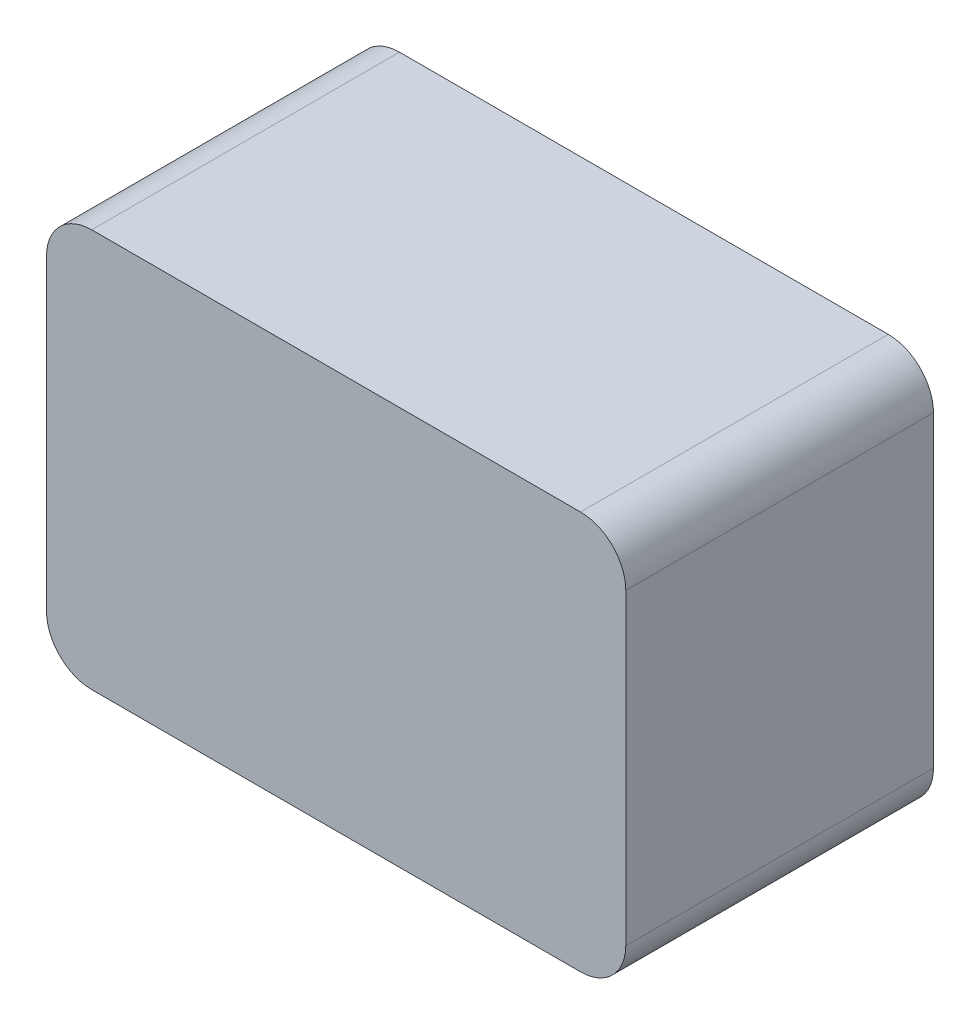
ISO-10303-21;
HEADER;
FILE_DESCRIPTION(('STEP AP214'),'2;1');
FILE_NAME('part.step','',(''),(''),'','','');
FILE_SCHEMA(('AUTOMOTIVE_DESIGN { 1 0 10303 214 1 1 1 1 }'));
ENDSEC;
DATA;
#1=APPLICATION_CONTEXT('core data for automotive mechanical design processes');
#2=APPLICATION_PROTOCOL_DEFINITION('international standard','automotive_design',2000,#1);
#3=PRODUCT_CONTEXT('',#1,'mechanical');
#4=PRODUCT('Part','Part','',(#3));
#5=PRODUCT_RELATED_PRODUCT_CATEGORY('part','',(#4));
#6=PRODUCT_DEFINITION_FORMATION('','',#4);
#7=PRODUCT_DEFINITION_CONTEXT('part definition',#1,'design');
#8=PRODUCT_DEFINITION('design','',#6,#7);
#9=PRODUCT_DEFINITION_SHAPE('','',#8);
#10=(LENGTH_UNIT() NAMED_UNIT(*) SI_UNIT(.MILLI.,.METRE.));
#11=(NAMED_UNIT(*) PLANE_ANGLE_UNIT() SI_UNIT($,.RADIAN.));
#12=(NAMED_UNIT(*) SI_UNIT($,.STERADIAN.) SOLID_ANGLE_UNIT());
#13=UNCERTAINTY_MEASURE_WITH_UNIT(LENGTH_MEASURE(1.E-05),#10,'distance_accuracy_value','');
#14=(GEOMETRIC_REPRESENTATION_CONTEXT(3) GLOBAL_UNCERTAINTY_ASSIGNED_CONTEXT((#13)) GLOBAL_UNIT_ASSIGNED_CONTEXT((#10,
#11,#12)) REPRESENTATION_CONTEXT('',''));
#15=CARTESIAN_POINT('',(0.,0.,0.));
#16=DIRECTION('',(0.,0.,1.));
#17=DIRECTION('',(1.,0.,0.));
#18=AXIS2_PLACEMENT_3D('',#15,#16,#17);
#19=CARTESIAN_POINT('',(-23.8143652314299,-18.2679047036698,0.));
#20=DIRECTION('',(0.,0.,1.));
#21=DIRECTION('',(1.,0.,0.));
#22=AXIS2_PLACEMENT_3D('',#19,#20,#21);
#23=PLANE('',#22);
#24=CARTESIAN_POINT('',(-23.8143652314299,-18.2679047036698,0.));
#25=DIRECTION('',(0.,0.,1.));
#26=DIRECTION('',(1.,0.,0.));
#27=AXIS2_PLACEMENT_3D('',#24,#25,#26);
#28=CIRCLE('',#27,5.);
#29=CARTESIAN_POINT('',(-28.8143652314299,-18.2679047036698,0.));
#30=VERTEX_POINT('',#29);
#31=CARTESIAN_POINT('',(-23.8143652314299,-23.2679047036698,0.));
#32=VERTEX_POINT('',#31);
#33=EDGE_CURVE('E153',#30,#32,#28,.T.);
#34=ORIENTED_EDGE('',*,*,#33,.F.);
#35=DIRECTION('',(0.,-1.,0.));
#36=VECTOR('',#35,1.);
#37=CARTESIAN_POINT('',(-28.8143652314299,15.7320952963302,0.));
#38=LINE('',#37,#36);
#39=CARTESIAN_POINT('',(-28.8143652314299,15.7320952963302,0.));
#40=VERTEX_POINT('',#39);
#41=EDGE_CURVE('E56',#40,#30,#38,.T.);
#42=ORIENTED_EDGE('',*,*,#41,.F.);
#43=CARTESIAN_POINT('',(-23.8143652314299,15.7320952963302,0.));
#44=DIRECTION('',(0.,0.,1.));
#45=DIRECTION('',(1.,0.,0.));
#46=AXIS2_PLACEMENT_3D('',#43,#44,#45);
#47=CIRCLE('',#46,5.);
#48=CARTESIAN_POINT('',(-23.8143652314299,20.7320952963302,0.));
#49=VERTEX_POINT('',#48);
#50=EDGE_CURVE('E257',#49,#40,#47,.T.);
#51=ORIENTED_EDGE('',*,*,#50,.F.);
#52=DIRECTION('',(-1.,0.,0.));
#53=VECTOR('',#52,1.);
#54=CARTESIAN_POINT('',(30.1856347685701,20.7320952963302,0.));
#55=LINE('',#54,#53);
#56=CARTESIAN_POINT('',(30.1856347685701,20.7320952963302,0.));
#57=VERTEX_POINT('',#56);
#58=EDGE_CURVE('E255',#57,#49,#55,.T.);
#59=ORIENTED_EDGE('',*,*,#58,.F.);
#60=CARTESIAN_POINT('',(30.1856347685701,15.7320952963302,0.));
#61=DIRECTION('',(0.,0.,1.));
#62=DIRECTION('',(1.,0.,0.));
#63=AXIS2_PLACEMENT_3D('',#60,#61,#62);
#64=CIRCLE('',#63,5.);
#65=CARTESIAN_POINT('',(35.1856347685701,15.7320952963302,0.));
#66=VERTEX_POINT('',#65);
#67=EDGE_CURVE('E253',#66,#57,#64,.T.);
#68=ORIENTED_EDGE('',*,*,#67,.F.);
#69=DIRECTION('',(0.,1.,0.));
#70=VECTOR('',#69,1.);
#71=CARTESIAN_POINT('',(35.1856347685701,-18.2679047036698,0.));
#72=LINE('',#71,#70);
#73=CARTESIAN_POINT('',(35.1856347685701,-18.2679047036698,0.));
#74=VERTEX_POINT('',#73);
#75=EDGE_CURVE('E251',#74,#66,#72,.T.);
#76=ORIENTED_EDGE('',*,*,#75,.F.);
#77=CARTESIAN_POINT('',(30.1856347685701,-18.2679047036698,0.));
#78=DIRECTION('',(0.,0.,1.));
#79=DIRECTION('',(1.,0.,0.));
#80=AXIS2_PLACEMENT_3D('',#77,#78,#79);
#81=CIRCLE('',#80,5.);
#82=CARTESIAN_POINT('',(30.1856347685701,-23.2679047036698,0.));
#83=VERTEX_POINT('',#82);
#84=EDGE_CURVE('E249',#83,#74,#81,.T.);
#85=ORIENTED_EDGE('',*,*,#84,.F.);
#86=DIRECTION('',(1.,0.,0.));
#87=VECTOR('',#86,1.);
#88=CARTESIAN_POINT('',(-23.8143652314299,-23.2679047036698,0.));
#89=LINE('',#88,#87);
#90=EDGE_CURVE('E247',#32,#83,#89,.T.);
#91=ORIENTED_EDGE('',*,*,#90,.F.);
#92=EDGE_LOOP('',(#34,#42,#51,#59,#68,#76,#85,#91));
#93=FACE_BOUND('',#92,.T.);
#94=CARTESIAN_POINT('',(-18.8143652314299,10.7320952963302,0.));
#95=DIRECTION('',(0.,0.,1.));
#96=DIRECTION('',(1.,0.,0.));
#97=AXIS2_PLACEMENT_3D('',#94,#95,#96);
#98=CIRCLE('',#97,5.25);
#99=CARTESIAN_POINT('',(-18.8143652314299,15.9820952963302,0.));
#100=VERTEX_POINT('',#99);
#101=CARTESIAN_POINT('',(-24.0643652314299,10.7320952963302,0.));
#102=VERTEX_POINT('',#101);
#103=EDGE_CURVE('E48',#100,#102,#98,.T.);
#104=ORIENTED_EDGE('',*,*,#103,.T.);
#105=DIRECTION('',(0.,-1.,0.));
#106=VECTOR('',#105,1.);
#107=CARTESIAN_POINT('',(-24.0643652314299,10.7320952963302,0.));
#108=LINE('',#107,#106);
#109=CARTESIAN_POINT('',(-24.0643652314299,-13.2679047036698,0.));
#110=VERTEX_POINT('',#109);
#111=EDGE_CURVE('E211',#102,#110,#108,.T.);
#112=ORIENTED_EDGE('',*,*,#111,.T.);
#113=CARTESIAN_POINT('',(-18.8143652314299,-13.2679047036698,0.));
#114=DIRECTION('',(0.,0.,1.));
#115=DIRECTION('',(1.,0.,0.));
#116=AXIS2_PLACEMENT_3D('',#113,#114,#115);
#117=CIRCLE('',#116,5.25);
#118=CARTESIAN_POINT('',(-18.8143652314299,-18.5179047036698,0.));
#119=VERTEX_POINT('',#118);
#120=EDGE_CURVE('E214',#110,#119,#117,.T.);
#121=ORIENTED_EDGE('',*,*,#120,.T.);
#122=DIRECTION('',(1.,0.,0.));
#123=VECTOR('',#122,1.);
#124=CARTESIAN_POINT('',(-18.8143652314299,-18.5179047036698,0.));
#125=LINE('',#124,#123);
#126=CARTESIAN_POINT('',(25.1856347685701,-18.5179047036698,0.));
#127=VERTEX_POINT('',#126);
#128=EDGE_CURVE('E217',#119,#127,#125,.T.);
#129=ORIENTED_EDGE('',*,*,#128,.T.);
#130=CARTESIAN_POINT('',(25.1856347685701,-13.2679047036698,0.));
#131=DIRECTION('',(0.,0.,1.));
#132=DIRECTION('',(1.,0.,0.));
#133=AXIS2_PLACEMENT_3D('',#130,#131,#132);
#134=CIRCLE('',#133,5.25);
#135=CARTESIAN_POINT('',(30.4356347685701,-13.2679047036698,0.));
#136=VERTEX_POINT('',#135);
#137=EDGE_CURVE('E220',#127,#136,#134,.T.);
#138=ORIENTED_EDGE('',*,*,#137,.T.);
#139=DIRECTION('',(0.,1.,0.));
#140=VECTOR('',#139,1.);
#141=CARTESIAN_POINT('',(30.4356347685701,-13.2679047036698,0.));
#142=LINE('',#141,#140);
#143=CARTESIAN_POINT('',(30.4356347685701,10.7320952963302,0.));
#144=VERTEX_POINT('',#143);
#145=EDGE_CURVE('E223',#136,#144,#142,.T.);
#146=ORIENTED_EDGE('',*,*,#145,.T.);
#147=CARTESIAN_POINT('',(25.1856347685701,10.7320952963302,0.));
#148=DIRECTION('',(0.,0.,1.));
#149=DIRECTION('',(1.,0.,0.));
#150=AXIS2_PLACEMENT_3D('',#147,#148,#149);
#151=CIRCLE('',#150,5.25);
#152=CARTESIAN_POINT('',(25.1856347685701,15.9820952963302,0.));
#153=VERTEX_POINT('',#152);
#154=EDGE_CURVE('E226',#144,#153,#151,.T.);
#155=ORIENTED_EDGE('',*,*,#154,.T.);
#156=DIRECTION('',(-1.,0.,0.));
#157=VECTOR('',#156,1.);
#158=CARTESIAN_POINT('',(25.1856347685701,15.9820952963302,0.));
#159=LINE('',#158,#157);
#160=EDGE_CURVE('E188',#153,#100,#159,.T.);
#161=ORIENTED_EDGE('',*,*,#160,.T.);
#162=EDGE_LOOP('',(#104,#112,#121,#129,#138,#146,#155,#161));
#163=FACE_BOUND('',#162,.T.);
#164=ADVANCED_FACE('F33',(#93,#163),#23,.F.);
#165=CARTESIAN_POINT('',(-23.8143652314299,-18.2679047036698,32.));
#166=DIRECTION('',(0.,0.,-1.));
#167=DIRECTION('',(-1.,0.,0.));
#168=AXIS2_PLACEMENT_3D('',#165,#166,#167);
#169=CYLINDRICAL_SURFACE('',#168,5.);
#170=ORIENTED_EDGE('',*,*,#33,.T.);
#171=DIRECTION('',(0.,0.,-1.));
#172=VECTOR('',#171,1.);
#173=CARTESIAN_POINT('',(-23.8143652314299,-23.2679047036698,32.));
#174=LINE('',#173,#172);
#175=CARTESIAN_POINT('',(-23.8143652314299,-23.2679047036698,34.));
#176=VERTEX_POINT('',#175);
#177=EDGE_CURVE('E11',#176,#32,#174,.T.);
#178=ORIENTED_EDGE('',*,*,#177,.F.);
#179=CARTESIAN_POINT('',(-23.8143652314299,-18.2679047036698,34.));
#180=DIRECTION('',(0.,0.,1.));
#181=DIRECTION('',(1.,0.,0.));
#182=AXIS2_PLACEMENT_3D('',#179,#180,#181);
#183=CIRCLE('',#182,5.);
#184=CARTESIAN_POINT('',(-28.8143652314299,-18.2679047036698,34.));
#185=VERTEX_POINT('',#184);
#186=EDGE_CURVE('E151',#185,#176,#183,.T.);
#187=ORIENTED_EDGE('',*,*,#186,.F.);
#188=DIRECTION('',(0.,0.,-1.));
#189=VECTOR('',#188,1.);
#190=CARTESIAN_POINT('',(-28.8143652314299,-18.2679047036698,32.));
#191=LINE('',#190,#189);
#192=EDGE_CURVE('E260',#185,#30,#191,.T.);
#193=ORIENTED_EDGE('',*,*,#192,.T.);
#194=EDGE_LOOP('',(#170,#178,#187,#193));
#195=FACE_BOUND('',#194,.T.);
#196=ADVANCED_FACE('F35',(#195),#169,.T.);
#197=CARTESIAN_POINT('',(-23.8143652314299,-23.2679047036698,32.));
#198=DIRECTION('',(0.,1.,0.));
#199=DIRECTION('',(-1.,0.,0.));
#200=AXIS2_PLACEMENT_3D('',#197,#198,#199);
#201=PLANE('',#200);
#202=ORIENTED_EDGE('',*,*,#90,.T.);
#203=DIRECTION('',(0.,0.,-1.));
#204=VECTOR('',#203,1.);
#205=CARTESIAN_POINT('',(30.1856347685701,-23.2679047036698,32.));
#206=LINE('',#205,#204);
#207=CARTESIAN_POINT('',(30.1856347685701,-23.2679047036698,34.));
#208=VERTEX_POINT('',#207);
#209=EDGE_CURVE('E41',#208,#83,#206,.T.);
#210=ORIENTED_EDGE('',*,*,#209,.F.);
#211=DIRECTION('',(1.,0.,0.));
#212=VECTOR('',#211,1.);
#213=CARTESIAN_POINT('',(-23.8143652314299,-23.2679047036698,34.));
#214=LINE('',#213,#212);
#215=EDGE_CURVE('E156',#176,#208,#214,.T.);
#216=ORIENTED_EDGE('',*,*,#215,.F.);
#217=ORIENTED_EDGE('',*,*,#177,.T.);
#218=EDGE_LOOP('',(#202,#210,#216,#217));
#219=FACE_BOUND('',#218,.T.);
#220=ADVANCED_FACE('F157',(#219),#201,.F.);
#221=CARTESIAN_POINT('',(30.1856347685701,-18.2679047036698,32.));
#222=DIRECTION('',(0.,0.,-1.));
#223=DIRECTION('',(-1.,0.,0.));
#224=AXIS2_PLACEMENT_3D('',#221,#222,#223);
#225=CYLINDRICAL_SURFACE('',#224,5.);
#226=ORIENTED_EDGE('',*,*,#84,.T.);
#227=DIRECTION('',(0.,0.,-1.));
#228=VECTOR('',#227,1.);
#229=CARTESIAN_POINT('',(35.1856347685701,-18.2679047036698,32.));
#230=LINE('',#229,#228);
#231=CARTESIAN_POINT('',(35.1856347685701,-18.2679047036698,34.));
#232=VERTEX_POINT('',#231);
#233=EDGE_CURVE('E273',#232,#74,#230,.T.);
#234=ORIENTED_EDGE('',*,*,#233,.F.);
#235=CARTESIAN_POINT('',(30.1856347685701,-18.2679047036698,34.));
#236=DIRECTION('',(0.,0.,1.));
#237=DIRECTION('',(1.,0.,0.));
#238=AXIS2_PLACEMENT_3D('',#235,#236,#237);
#239=CIRCLE('',#238,5.);
#240=EDGE_CURVE('E162',#208,#232,#239,.T.);
#241=ORIENTED_EDGE('',*,*,#240,.F.);
#242=ORIENTED_EDGE('',*,*,#209,.T.);
#243=EDGE_LOOP('',(#226,#234,#241,#242));
#244=FACE_BOUND('',#243,.T.);
#245=ADVANCED_FACE('F277',(#244),#225,.T.);
#246=CARTESIAN_POINT('',(35.1856347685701,-18.2679047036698,32.));
#247=DIRECTION('',(-1.,0.,0.));
#248=DIRECTION('',(0.,0.,1.));
#249=AXIS2_PLACEMENT_3D('',#246,#247,#248);
#250=PLANE('',#249);
#251=ORIENTED_EDGE('',*,*,#75,.T.);
#252=DIRECTION('',(0.,0.,-1.));
#253=VECTOR('',#252,1.);
#254=CARTESIAN_POINT('',(35.1856347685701,15.7320952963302,32.));
#255=LINE('',#254,#253);
#256=CARTESIAN_POINT('',(35.1856347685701,15.7320952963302,34.));
#257=VERTEX_POINT('',#256);
#258=EDGE_CURVE('E270',#257,#66,#255,.T.);
#259=ORIENTED_EDGE('',*,*,#258,.F.);
#260=DIRECTION('',(0.,1.,0.));
#261=VECTOR('',#260,1.);
#262=CARTESIAN_POINT('',(35.1856347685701,-18.2679047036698,34.));
#263=LINE('',#262,#261);
#264=EDGE_CURVE('E172',#232,#257,#263,.T.);
#265=ORIENTED_EDGE('',*,*,#264,.F.);
#266=ORIENTED_EDGE('',*,*,#233,.T.);
#267=EDGE_LOOP('',(#251,#259,#265,#266));
#268=FACE_BOUND('',#267,.T.);
#269=ADVANCED_FACE('F284',(#268),#250,.F.);
#270=CARTESIAN_POINT('',(30.1856347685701,15.7320952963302,32.));
#271=DIRECTION('',(0.,0.,-1.));
#272=DIRECTION('',(-1.,0.,0.));
#273=AXIS2_PLACEMENT_3D('',#270,#271,#272);
#274=CYLINDRICAL_SURFACE('',#273,5.);
#275=ORIENTED_EDGE('',*,*,#67,.T.);
#276=DIRECTION('',(0.,0.,-1.));
#277=VECTOR('',#276,1.);
#278=CARTESIAN_POINT('',(30.1856347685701,20.7320952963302,32.));
#279=LINE('',#278,#277);
#280=CARTESIAN_POINT('',(30.1856347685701,20.7320952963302,34.));
#281=VERTEX_POINT('',#280);
#282=EDGE_CURVE('E267',#281,#57,#279,.T.);
#283=ORIENTED_EDGE('',*,*,#282,.F.);
#284=CARTESIAN_POINT('',(30.1856347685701,15.7320952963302,34.));
#285=DIRECTION('',(0.,0.,1.));
#286=DIRECTION('',(1.,0.,0.));
#287=AXIS2_PLACEMENT_3D('',#284,#285,#286);
#288=CIRCLE('',#287,5.);
#289=EDGE_CURVE('E175',#257,#281,#288,.T.);
#290=ORIENTED_EDGE('',*,*,#289,.F.);
#291=ORIENTED_EDGE('',*,*,#258,.T.);
#292=EDGE_LOOP('',(#275,#283,#290,#291));
#293=FACE_BOUND('',#292,.T.);
#294=ADVANCED_FACE('F288',(#293),#274,.T.);
#295=CARTESIAN_POINT('',(30.1856347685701,20.7320952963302,32.));
#296=DIRECTION('',(0.,-1.,0.));
#297=DIRECTION('',(0.,0.,-1.));
#298=AXIS2_PLACEMENT_3D('',#295,#296,#297);
#299=PLANE('',#298);
#300=ORIENTED_EDGE('',*,*,#58,.T.);
#301=DIRECTION('',(0.,0.,-1.));
#302=VECTOR('',#301,1.);
#303=CARTESIAN_POINT('',(-23.8143652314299,20.7320952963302,32.));
#304=LINE('',#303,#302);
#305=CARTESIAN_POINT('',(-23.8143652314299,20.7320952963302,34.));
#306=VERTEX_POINT('',#305);
#307=EDGE_CURVE('E264',#306,#49,#304,.T.);
#308=ORIENTED_EDGE('',*,*,#307,.F.);
#309=DIRECTION('',(-1.,0.,0.));
#310=VECTOR('',#309,1.);
#311=CARTESIAN_POINT('',(30.1856347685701,20.7320952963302,34.));
#312=LINE('',#311,#310);
#313=EDGE_CURVE('E178',#281,#306,#312,.T.);
#314=ORIENTED_EDGE('',*,*,#313,.F.);
#315=ORIENTED_EDGE('',*,*,#282,.T.);
#316=EDGE_LOOP('',(#300,#308,#314,#315));
#317=FACE_BOUND('',#316,.T.);
#318=ADVANCED_FACE('F292',(#317),#299,.F.);
#319=CARTESIAN_POINT('',(-23.8143652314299,15.7320952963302,32.));
#320=DIRECTION('',(0.,0.,-1.));
#321=DIRECTION('',(-1.,0.,0.));
#322=AXIS2_PLACEMENT_3D('',#319,#320,#321);
#323=CYLINDRICAL_SURFACE('',#322,5.);
#324=ORIENTED_EDGE('',*,*,#50,.T.);
#325=DIRECTION('',(0.,0.,-1.));
#326=VECTOR('',#325,1.);
#327=CARTESIAN_POINT('',(-28.8143652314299,15.7320952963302,32.));
#328=LINE('',#327,#326);
#329=CARTESIAN_POINT('',(-28.8143652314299,15.7320952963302,34.));
#330=VERTEX_POINT('',#329);
#331=EDGE_CURVE('E262',#330,#40,#328,.T.);
#332=ORIENTED_EDGE('',*,*,#331,.F.);
#333=CARTESIAN_POINT('',(-23.8143652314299,15.7320952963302,34.));
#334=DIRECTION('',(0.,0.,1.));
#335=DIRECTION('',(1.,0.,0.));
#336=AXIS2_PLACEMENT_3D('',#333,#334,#335);
#337=CIRCLE('',#336,5.);
#338=EDGE_CURVE('E181',#306,#330,#337,.T.);
#339=ORIENTED_EDGE('',*,*,#338,.F.);
#340=ORIENTED_EDGE('',*,*,#307,.T.);
#341=EDGE_LOOP('',(#324,#332,#339,#340));
#342=FACE_BOUND('',#341,.T.);
#343=ADVANCED_FACE('F295',(#342),#323,.T.);
#344=CARTESIAN_POINT('',(-28.8143652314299,15.7320952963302,32.));
#345=DIRECTION('',(1.,0.,0.));
#346=DIRECTION('',(0.,1.,0.));
#347=AXIS2_PLACEMENT_3D('',#344,#345,#346);
#348=PLANE('',#347);
#349=ORIENTED_EDGE('',*,*,#41,.T.);
#350=ORIENTED_EDGE('',*,*,#192,.F.);
#351=DIRECTION('',(0.,-1.,0.));
#352=VECTOR('',#351,1.);
#353=CARTESIAN_POINT('',(-28.8143652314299,15.7320952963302,34.));
#354=LINE('',#353,#352);
#355=EDGE_CURVE('E168',#330,#185,#354,.T.);
#356=ORIENTED_EDGE('',*,*,#355,.F.);
#357=ORIENTED_EDGE('',*,*,#331,.T.);
#358=EDGE_LOOP('',(#349,#350,#356,#357));
#359=FACE_BOUND('',#358,.T.);
#360=ADVANCED_FACE('F296',(#359),#348,.F.);
#361=CARTESIAN_POINT('',(-18.8143652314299,10.7320952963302,32.));
#362=DIRECTION('',(0.,0.,-1.));
#363=DIRECTION('',(-1.,0.,0.));
#364=AXIS2_PLACEMENT_3D('',#361,#362,#363);
#365=CYLINDRICAL_SURFACE('',#364,5.25);
#366=ORIENTED_EDGE('',*,*,#103,.F.);
#367=DIRECTION('',(0.,0.,-1.));
#368=VECTOR('',#367,1.);
#369=CARTESIAN_POINT('',(-18.8143652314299,15.9820952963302,32.));
#370=LINE('',#369,#368);
#371=CARTESIAN_POINT('',(-18.8143652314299,15.9820952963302,32.));
#372=VERTEX_POINT('',#371);
#373=EDGE_CURVE('E209',#372,#100,#370,.T.);
#374=ORIENTED_EDGE('',*,*,#373,.F.);
#375=CARTESIAN_POINT('',(-18.8143652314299,10.7320952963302,32.));
#376=DIRECTION('',(0.,0.,1.));
#377=DIRECTION('',(1.,0.,0.));
#378=AXIS2_PLACEMENT_3D('',#375,#376,#377);
#379=CIRCLE('',#378,5.25);
#380=CARTESIAN_POINT('',(-24.0643652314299,10.7320952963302,32.));
#381=VERTEX_POINT('',#380);
#382=EDGE_CURVE('E184',#372,#381,#379,.T.);
#383=ORIENTED_EDGE('',*,*,#382,.T.);
#384=DIRECTION('',(0.,0.,-1.));
#385=VECTOR('',#384,1.);
#386=CARTESIAN_POINT('',(-24.0643652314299,10.7320952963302,32.));
#387=LINE('',#386,#385);
#388=EDGE_CURVE('E244',#381,#102,#387,.T.);
#389=ORIENTED_EDGE('',*,*,#388,.T.);
#390=EDGE_LOOP('',(#366,#374,#383,#389));
#391=FACE_BOUND('',#390,.T.);
#392=ADVANCED_FACE('F298',(#391),#365,.F.);
#393=CARTESIAN_POINT('',(-24.0643652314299,10.7320952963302,32.));
#394=DIRECTION('',(1.,0.,0.));
#395=DIRECTION('',(0.,1.,0.));
#396=AXIS2_PLACEMENT_3D('',#393,#394,#395);
#397=PLANE('',#396);
#398=ORIENTED_EDGE('',*,*,#111,.F.);
#399=ORIENTED_EDGE('',*,*,#388,.F.);
#400=DIRECTION('',(0.,-1.,0.));
#401=VECTOR('',#400,1.);
#402=CARTESIAN_POINT('',(-24.0643652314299,10.7320952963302,32.));
#403=LINE('',#402,#401);
#404=CARTESIAN_POINT('',(-24.0643652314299,-13.2679047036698,32.));
#405=VERTEX_POINT('',#404);
#406=EDGE_CURVE('E187',#381,#405,#403,.T.);
#407=ORIENTED_EDGE('',*,*,#406,.T.);
#408=DIRECTION('',(0.,0.,-1.));
#409=VECTOR('',#408,1.);
#410=CARTESIAN_POINT('',(-24.0643652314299,-13.2679047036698,32.));
#411=LINE('',#410,#409);
#412=EDGE_CURVE('E242',#405,#110,#411,.T.);
#413=ORIENTED_EDGE('',*,*,#412,.T.);
#414=EDGE_LOOP('',(#398,#399,#407,#413));
#415=FACE_BOUND('',#414,.T.);
#416=ADVANCED_FACE('F304',(#415),#397,.T.);
#417=CARTESIAN_POINT('',(-18.8143652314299,-13.2679047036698,32.));
#418=DIRECTION('',(0.,0.,-1.));
#419=DIRECTION('',(-1.,0.,0.));
#420=AXIS2_PLACEMENT_3D('',#417,#418,#419);
#421=CYLINDRICAL_SURFACE('',#420,5.25);
#422=ORIENTED_EDGE('',*,*,#120,.F.);
#423=ORIENTED_EDGE('',*,*,#412,.F.);
#424=CARTESIAN_POINT('',(-18.8143652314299,-13.2679047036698,32.));
#425=DIRECTION('',(0.,0.,1.));
#426=DIRECTION('',(1.,0.,0.));
#427=AXIS2_PLACEMENT_3D('',#424,#425,#426);
#428=CIRCLE('',#427,5.25);
#429=CARTESIAN_POINT('',(-18.8143652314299,-18.5179047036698,32.));
#430=VERTEX_POINT('',#429);
#431=EDGE_CURVE('E191',#405,#430,#428,.T.);
#432=ORIENTED_EDGE('',*,*,#431,.T.);
#433=DIRECTION('',(0.,0.,-1.));
#434=VECTOR('',#433,1.);
#435=CARTESIAN_POINT('',(-18.8143652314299,-18.5179047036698,32.));
#436=LINE('',#435,#434);
#437=EDGE_CURVE('E240',#430,#119,#436,.T.);
#438=ORIENTED_EDGE('',*,*,#437,.T.);
#439=EDGE_LOOP('',(#422,#423,#432,#438));
#440=FACE_BOUND('',#439,.T.);
#441=ADVANCED_FACE('F315',(#440),#421,.F.);
#442=CARTESIAN_POINT('',(-18.8143652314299,-18.5179047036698,32.));
#443=DIRECTION('',(0.,1.,0.));
#444=DIRECTION('',(-1.,0.,0.));
#445=AXIS2_PLACEMENT_3D('',#442,#443,#444);
#446=PLANE('',#445);
#447=ORIENTED_EDGE('',*,*,#128,.F.);
#448=ORIENTED_EDGE('',*,*,#437,.F.);
#449=DIRECTION('',(1.,0.,0.));
#450=VECTOR('',#449,1.);
#451=CARTESIAN_POINT('',(-18.8143652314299,-18.5179047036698,32.));
#452=LINE('',#451,#450);
#453=CARTESIAN_POINT('',(25.1856347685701,-18.5179047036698,32.));
#454=VERTEX_POINT('',#453);
#455=EDGE_CURVE('E194',#430,#454,#452,.T.);
#456=ORIENTED_EDGE('',*,*,#455,.T.);
#457=DIRECTION('',(0.,0.,-1.));
#458=VECTOR('',#457,1.);
#459=CARTESIAN_POINT('',(25.1856347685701,-18.5179047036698,32.));
#460=LINE('',#459,#458);
#461=EDGE_CURVE('E238',#454,#127,#460,.T.);
#462=ORIENTED_EDGE('',*,*,#461,.T.);
#463=EDGE_LOOP('',(#447,#448,#456,#462));
#464=FACE_BOUND('',#463,.T.);
#465=ADVANCED_FACE('F319',(#464),#446,.T.);
#466=CARTESIAN_POINT('',(25.1856347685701,-13.2679047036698,32.));
#467=DIRECTION('',(0.,0.,-1.));
#468=DIRECTION('',(-1.,0.,0.));
#469=AXIS2_PLACEMENT_3D('',#466,#467,#468);
#470=CYLINDRICAL_SURFACE('',#469,5.25);
#471=ORIENTED_EDGE('',*,*,#137,.F.);
#472=ORIENTED_EDGE('',*,*,#461,.F.);
#473=CARTESIAN_POINT('',(25.1856347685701,-13.2679047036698,32.));
#474=DIRECTION('',(0.,0.,1.));
#475=DIRECTION('',(1.,0.,0.));
#476=AXIS2_PLACEMENT_3D('',#473,#474,#475);
#477=CIRCLE('',#476,5.25);
#478=CARTESIAN_POINT('',(30.4356347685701,-13.2679047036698,32.));
#479=VERTEX_POINT('',#478);
#480=EDGE_CURVE('E197',#454,#479,#477,.T.);
#481=ORIENTED_EDGE('',*,*,#480,.T.);
#482=DIRECTION('',(0.,0.,-1.));
#483=VECTOR('',#482,1.);
#484=CARTESIAN_POINT('',(30.4356347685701,-13.2679047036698,32.));
#485=LINE('',#484,#483);
#486=EDGE_CURVE('E236',#479,#136,#485,.T.);
#487=ORIENTED_EDGE('',*,*,#486,.T.);
#488=EDGE_LOOP('',(#471,#472,#481,#487));
#489=FACE_BOUND('',#488,.T.);
#490=ADVANCED_FACE('F323',(#489),#470,.F.);
#491=CARTESIAN_POINT('',(30.4356347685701,-13.2679047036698,32.));
#492=DIRECTION('',(-1.,0.,0.));
#493=DIRECTION('',(0.,0.,1.));
#494=AXIS2_PLACEMENT_3D('',#491,#492,#493);
#495=PLANE('',#494);
#496=ORIENTED_EDGE('',*,*,#145,.F.);
#497=ORIENTED_EDGE('',*,*,#486,.F.);
#498=DIRECTION('',(0.,1.,0.));
#499=VECTOR('',#498,1.);
#500=CARTESIAN_POINT('',(30.4356347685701,-13.2679047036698,32.));
#501=LINE('',#500,#499);
#502=CARTESIAN_POINT('',(30.4356347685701,10.7320952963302,32.));
#503=VERTEX_POINT('',#502);
#504=EDGE_CURVE('E200',#479,#503,#501,.T.);
#505=ORIENTED_EDGE('',*,*,#504,.T.);
#506=DIRECTION('',(0.,0.,-1.));
#507=VECTOR('',#506,1.);
#508=CARTESIAN_POINT('',(30.4356347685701,10.7320952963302,32.));
#509=LINE('',#508,#507);
#510=EDGE_CURVE('E234',#503,#144,#509,.T.);
#511=ORIENTED_EDGE('',*,*,#510,.T.);
#512=EDGE_LOOP('',(#496,#497,#505,#511));
#513=FACE_BOUND('',#512,.T.);
#514=ADVANCED_FACE('F327',(#513),#495,.T.);
#515=CARTESIAN_POINT('',(25.1856347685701,10.7320952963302,32.));
#516=DIRECTION('',(0.,0.,-1.));
#517=DIRECTION('',(-1.,0.,0.));
#518=AXIS2_PLACEMENT_3D('',#515,#516,#517);
#519=CYLINDRICAL_SURFACE('',#518,5.25);
#520=ORIENTED_EDGE('',*,*,#154,.F.);
#521=ORIENTED_EDGE('',*,*,#510,.F.);
#522=CARTESIAN_POINT('',(25.1856347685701,10.7320952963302,32.));
#523=DIRECTION('',(0.,0.,1.));
#524=DIRECTION('',(1.,0.,0.));
#525=AXIS2_PLACEMENT_3D('',#522,#523,#524);
#526=CIRCLE('',#525,5.25);
#527=CARTESIAN_POINT('',(25.1856347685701,15.9820952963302,32.));
#528=VERTEX_POINT('',#527);
#529=EDGE_CURVE('E203',#503,#528,#526,.T.);
#530=ORIENTED_EDGE('',*,*,#529,.T.);
#531=DIRECTION('',(0.,0.,-1.));
#532=VECTOR('',#531,1.);
#533=CARTESIAN_POINT('',(25.1856347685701,15.9820952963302,32.));
#534=LINE('',#533,#532);
#535=EDGE_CURVE('E232',#528,#153,#534,.T.);
#536=ORIENTED_EDGE('',*,*,#535,.T.);
#537=EDGE_LOOP('',(#520,#521,#530,#536));
#538=FACE_BOUND('',#537,.T.);
#539=ADVANCED_FACE('F331',(#538),#519,.F.);
#540=CARTESIAN_POINT('',(25.1856347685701,15.9820952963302,32.));
#541=DIRECTION('',(0.,-1.,0.));
#542=DIRECTION('',(1.,0.,0.));
#543=AXIS2_PLACEMENT_3D('',#540,#541,#542);
#544=PLANE('',#543);
#545=ORIENTED_EDGE('',*,*,#160,.F.);
#546=ORIENTED_EDGE('',*,*,#535,.F.);
#547=DIRECTION('',(-1.,0.,0.));
#548=VECTOR('',#547,1.);
#549=CARTESIAN_POINT('',(25.1856347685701,15.9820952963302,32.));
#550=LINE('',#549,#548);
#551=EDGE_CURVE('E206',#528,#372,#550,.T.);
#552=ORIENTED_EDGE('',*,*,#551,.T.);
#553=ORIENTED_EDGE('',*,*,#373,.T.);
#554=EDGE_LOOP('',(#545,#546,#552,#553));
#555=FACE_BOUND('',#554,.T.);
#556=ADVANCED_FACE('F335',(#555),#544,.T.);
#557=CARTESIAN_POINT('',(-23.8143652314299,-18.2679047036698,32.));
#558=DIRECTION('',(0.,0.,1.));
#559=DIRECTION('',(1.,0.,0.));
#560=AXIS2_PLACEMENT_3D('',#557,#558,#559);
#561=PLANE('',#560);
#562=ORIENTED_EDGE('',*,*,#406,.F.);
#563=ORIENTED_EDGE('',*,*,#382,.F.);
#564=ORIENTED_EDGE('',*,*,#551,.F.);
#565=ORIENTED_EDGE('',*,*,#529,.F.);
#566=ORIENTED_EDGE('',*,*,#504,.F.);
#567=ORIENTED_EDGE('',*,*,#480,.F.);
#568=ORIENTED_EDGE('',*,*,#455,.F.);
#569=ORIENTED_EDGE('',*,*,#431,.F.);
#570=EDGE_LOOP('',(#562,#563,#564,#565,#566,#567,#568,#569));
#571=FACE_BOUND('',#570,.T.);
#572=ADVANCED_FACE('F339',(#571),#561,.F.);
#573=CARTESIAN_POINT('',(-23.8143652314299,-18.2679047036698,34.));
#574=DIRECTION('',(0.,0.,1.));
#575=DIRECTION('',(1.,0.,0.));
#576=AXIS2_PLACEMENT_3D('',#573,#574,#575);
#577=PLANE('',#576);
#578=ORIENTED_EDGE('',*,*,#186,.T.);
#579=ORIENTED_EDGE('',*,*,#215,.T.);
#580=ORIENTED_EDGE('',*,*,#240,.T.);
#581=ORIENTED_EDGE('',*,*,#264,.T.);
#582=ORIENTED_EDGE('',*,*,#289,.T.);
#583=ORIENTED_EDGE('',*,*,#313,.T.);
#584=ORIENTED_EDGE('',*,*,#338,.T.);
#585=ORIENTED_EDGE('',*,*,#355,.T.);
#586=EDGE_LOOP('',(#578,#579,#580,#581,#582,#583,#584,#585));
#587=FACE_BOUND('',#586,.T.);
#588=ADVANCED_FACE('F165',(#587),#577,.T.);
#589=CLOSED_SHELL('',(#164,#196,#220,#245,#269,#294,#318,#343,#360,#392,#416,#441,#465,#490,
#514,#539,#556,#572,#588));
#590=MANIFOLD_SOLID_BREP('B2',#589);
#591=ADVANCED_BREP_SHAPE_REPRESENTATION('',(#18,#590),#14);
#592=SHAPE_DEFINITION_REPRESENTATION(#9,#591);
ENDSEC;
END-ISO-10303-21;
